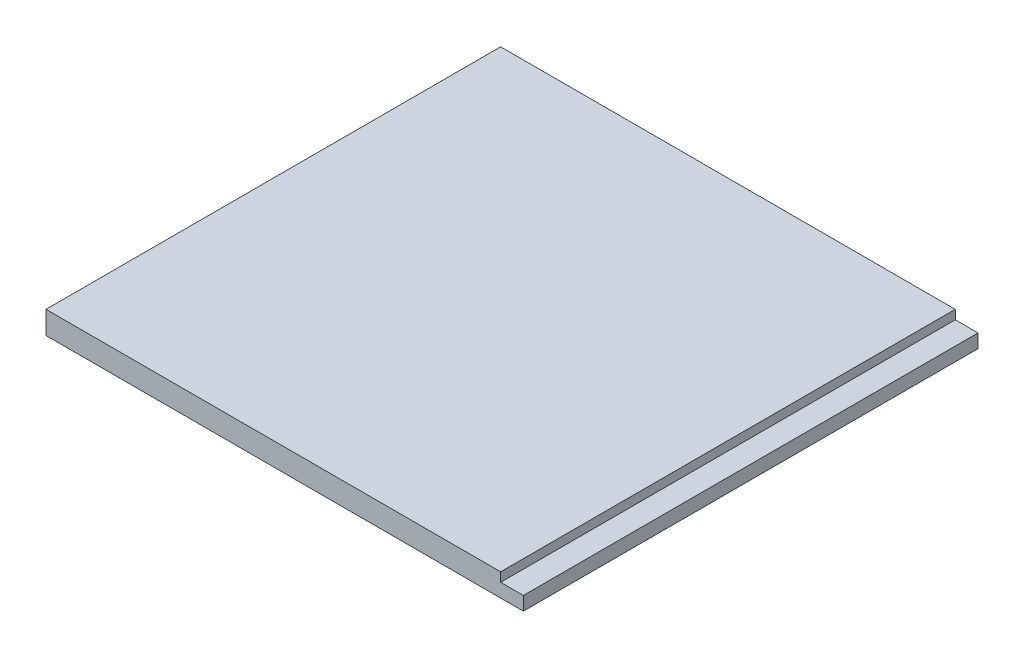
from build123d import *

# Parameters (mm, degrees)
BOSS_EXTRU_1_DEPTH      = 10000
ENL_V_MAT_EXTRU_1_DEPTH = 100


with BuildPart() as part:
    # Esquisse1 → Boss.-Extru.1 (new, symmetric)
    with BuildSketch(Plane.XY):
        Polygon((0, 0), (0, -1000), (21000, -1000), (21000, -400), (20000, -400), (20000, 0), align=None)
    extrude(amount=BOSS_EXTRU_1_DEPTH, both=True)

    # Esquisse2 → Enl_v. mat.-Extru.1 (cut)
    with BuildSketch(Plane(origin=(0, -1000, 0), x_dir=(1, 0, 0), z_dir=(0, 1, 0))):
        with BuildLine():
            Line((15000, 50), (15000, 200))
            Line((15000, 200), (14900, 200))
            Line((14900, 200), (14900, -200))
            Line((14900, -200), (15000, -200))
            Line((15000, -200), (15000, -50))
            ThreePointArc((15000, -50), (15050, 0), (15000, 50))
        make_face()
    extrude(amount=ENL_V_MAT_EXTRU_1_DEPTH, mode=Mode.SUBTRACT)


solid = part.part
